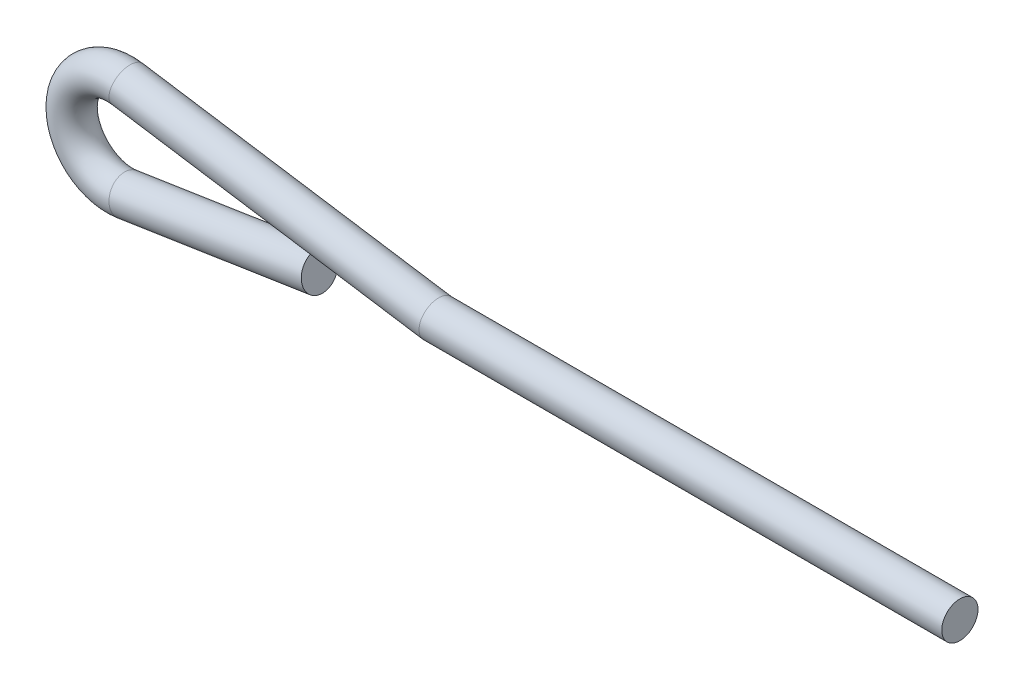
ISO-10303-21;
HEADER;
FILE_DESCRIPTION(('STEP AP214'),'2;1');
FILE_NAME('part.step','',(''),(''),'','','');
FILE_SCHEMA(('AUTOMOTIVE_DESIGN { 1 0 10303 214 1 1 1 1 }'));
ENDSEC;
DATA;
#1=APPLICATION_CONTEXT('core data for automotive mechanical design processes');
#2=APPLICATION_PROTOCOL_DEFINITION('international standard','automotive_design',2000,#1);
#3=PRODUCT_CONTEXT('',#1,'mechanical');
#4=PRODUCT('Part','Part','',(#3));
#5=PRODUCT_RELATED_PRODUCT_CATEGORY('part','',(#4));
#6=PRODUCT_DEFINITION_FORMATION('','',#4);
#7=PRODUCT_DEFINITION_CONTEXT('part definition',#1,'design');
#8=PRODUCT_DEFINITION('design','',#6,#7);
#9=PRODUCT_DEFINITION_SHAPE('','',#8);
#10=(LENGTH_UNIT() NAMED_UNIT(*) SI_UNIT(.MILLI.,.METRE.));
#11=(NAMED_UNIT(*) PLANE_ANGLE_UNIT() SI_UNIT($,.RADIAN.));
#12=(NAMED_UNIT(*) SI_UNIT($,.STERADIAN.) SOLID_ANGLE_UNIT());
#13=UNCERTAINTY_MEASURE_WITH_UNIT(LENGTH_MEASURE(1.E-05),#10,'distance_accuracy_value','');
#14=(GEOMETRIC_REPRESENTATION_CONTEXT(3) GLOBAL_UNCERTAINTY_ASSIGNED_CONTEXT((#13)) GLOBAL_UNIT_ASSIGNED_CONTEXT((#10,
#11,#12)) REPRESENTATION_CONTEXT('',''));
#15=CARTESIAN_POINT('',(0.,0.,0.));
#16=DIRECTION('',(0.,0.,1.));
#17=DIRECTION('',(1.,0.,0.));
#18=AXIS2_PLACEMENT_3D('',#15,#16,#17);
#19=CARTESIAN_POINT('',(105.,0.,0.));
#20=DIRECTION('',(1.,0.,0.));
#21=DIRECTION('',(0.,1.,0.));
#22=AXIS2_PLACEMENT_3D('',#19,#20,#21);
#23=CYLINDRICAL_SURFACE('',#22,6.);
#24=CARTESIAN_POINT('',(105.,0.,0.));
#25=DIRECTION('',(0.99707618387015,-0.0764138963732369,0.));
#26=DIRECTION('',(-0.0764138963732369,-0.99707618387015,0.));
#27=AXIS2_PLACEMENT_3D('',#24,#25,#26);
#28=ELLIPSE('',#27,6.01759433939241,6.);
#29=CARTESIAN_POINT('',(104.540172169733,-6.00000000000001,0.));
#30=VERTEX_POINT('',#29);
#31=EDGE_CURVE('E49',#30,#30,#28,.F.);
#32=ORIENTED_EDGE('',*,*,#31,.F.);
#33=EDGE_LOOP('',(#32));
#34=FACE_BOUND('',#33,.T.);
#35=CARTESIAN_POINT('',(278.,0.,0.));
#36=DIRECTION('',(1.,0.,0.));
#37=DIRECTION('',(0.,1.,0.));
#38=AXIS2_PLACEMENT_3D('',#35,#36,#37);
#39=CIRCLE('',#38,6.);
#40=CARTESIAN_POINT('',(278.,6.00000000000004,0.));
#41=VERTEX_POINT('',#40);
#42=EDGE_CURVE('E11',#41,#41,#39,.T.);
#43=ORIENTED_EDGE('',*,*,#42,.F.);
#44=EDGE_LOOP('',(#43));
#45=FACE_BOUND('',#44,.T.);
#46=ADVANCED_FACE('F43',(#34,#45),#23,.T.);
#47=CARTESIAN_POINT('',(2.43809523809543,15.8131493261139,0.));
#48=DIRECTION('',(0.98832183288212,-0.152380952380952,0.));
#49=DIRECTION('',(0.152380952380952,0.98832183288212,0.));
#50=AXIS2_PLACEMENT_3D('',#47,#48,#49);
#51=CYLINDRICAL_SURFACE('',#50,6.);
#52=CARTESIAN_POINT('',(2.43809523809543,15.8131493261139,0.));
#53=DIRECTION('',(0.988321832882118,-0.152380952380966,0.));
#54=DIRECTION('',(0.152380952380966,0.988321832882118,0.));
#55=AXIS2_PLACEMENT_3D('',#52,#53,#54);
#56=CIRCLE('',#55,6.);
#57=CARTESIAN_POINT('',(3.35238095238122,21.7430803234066,0.));
#58=VERTEX_POINT('',#57);
#59=EDGE_CURVE('E54',#58,#58,#56,.T.);
#60=ORIENTED_EDGE('',*,*,#59,.T.);
#61=EDGE_LOOP('',(#60));
#62=FACE_BOUND('',#61,.T.);
#63=ORIENTED_EDGE('',*,*,#31,.T.);
#64=EDGE_LOOP('',(#63));
#65=FACE_BOUND('',#64,.T.);
#66=ADVANCED_FACE('F86',(#62,#65),#51,.T.);
#67=CARTESIAN_POINT('',(0.,0.,0.));
#68=DIRECTION('',(0.,0.,-1.));
#69=DIRECTION('',(-1.,0.,0.));
#70=AXIS2_PLACEMENT_3D('',#67,#68,#69);
#71=TOROIDAL_SURFACE('',#70,16.,6.);
#72=CARTESIAN_POINT('',(2.43809523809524,-15.8131493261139,0.));
#73=DIRECTION('',(-0.988321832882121,-0.152380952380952,0.));
#74=DIRECTION('',(0.152380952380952,-0.988321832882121,0.));
#75=AXIS2_PLACEMENT_3D('',#72,#73,#74);
#76=CIRCLE('',#75,6.);
#77=CARTESIAN_POINT('',(3.35238095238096,-21.7430803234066,0.));
#78=VERTEX_POINT('',#77);
#79=EDGE_CURVE('E60',#78,#78,#76,.T.);
#80=CARTESIAN_POINT('',(0.,0.,0.));
#81=DIRECTION('',(0.,0.,-1.));
#82=DIRECTION('',(-1.,0.,0.));
#83=AXIS2_PLACEMENT_3D('',#80,#81,#82);
#84=CIRCLE('',#83,22.);
#85=EDGE_CURVE('',#78,#58,#84,.T.);
#86=ORIENTED_EDGE('',*,*,#79,.T.);
#87=ORIENTED_EDGE('',*,*,#59,.F.);
#88=ORIENTED_EDGE('',*,*,#85,.T.);
#89=ORIENTED_EDGE('',*,*,#85,.F.);
#90=EDGE_LOOP('',(#86,#88,#87,#89));
#91=FACE_BOUND('',#90,.T.);
#92=ADVANCED_FACE('F69',(#91),#71,.T.);
#93=CARTESIAN_POINT('',(2.43809523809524,-15.8131493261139,0.));
#94=DIRECTION('',(0.98832183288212,0.152380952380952,0.));
#95=DIRECTION('',(-0.152380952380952,0.988321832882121,0.));
#96=AXIS2_PLACEMENT_3D('',#93,#94,#95);
#97=CYLINDRICAL_SURFACE('',#96,6.);
#98=ORIENTED_EDGE('',*,*,#79,.F.);
#99=EDGE_LOOP('',(#98));
#100=FACE_BOUND('',#99,.T.);
#101=CARTESIAN_POINT('',(66.0848278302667,-5.99999999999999,0.));
#102=DIRECTION('',(-0.988321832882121,-0.152380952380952,0.));
#103=DIRECTION('',(0.152380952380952,-0.988321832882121,0.));
#104=AXIS2_PLACEMENT_3D('',#101,#102,#103);
#105=CIRCLE('',#104,6.);
#106=CARTESIAN_POINT('',(66.9991135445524,-11.9299309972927,0.));
#107=VERTEX_POINT('',#106);
#108=EDGE_CURVE('E63',#107,#107,#105,.T.);
#109=ORIENTED_EDGE('',*,*,#108,.T.);
#110=EDGE_LOOP('',(#109));
#111=FACE_BOUND('',#110,.T.);
#112=ADVANCED_FACE('F72',(#100,#111),#97,.T.);
#113=CARTESIAN_POINT('',(66.0848278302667,-5.99999999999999,0.));
#114=DIRECTION('',(-0.988321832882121,-0.152380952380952,0.));
#115=DIRECTION('',(0.152380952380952,-0.988321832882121,0.));
#116=AXIS2_PLACEMENT_3D('',#113,#114,#115);
#117=PLANE('',#116);
#118=ORIENTED_EDGE('',*,*,#108,.F.);
#119=EDGE_LOOP('',(#118));
#120=FACE_BOUND('',#119,.T.);
#121=ADVANCED_FACE('F75',(#120),#117,.F.);
#122=CARTESIAN_POINT('',(278.,0.,0.));
#123=DIRECTION('',(1.,0.,0.));
#124=DIRECTION('',(0.,1.,0.));
#125=AXIS2_PLACEMENT_3D('',#122,#123,#124);
#126=PLANE('',#125);
#127=ORIENTED_EDGE('',*,*,#42,.T.);
#128=EDGE_LOOP('',(#127));
#129=FACE_BOUND('',#128,.T.);
#130=ADVANCED_FACE('F80',(#129),#126,.T.);
#131=CLOSED_SHELL('',(#46,#66,#92,#112,#121,#130));
#132=MANIFOLD_SOLID_BREP('B2',#131);
#133=ADVANCED_BREP_SHAPE_REPRESENTATION('',(#18,#132),#14);
#134=SHAPE_DEFINITION_REPRESENTATION(#9,#133);
ENDSEC;
END-ISO-10303-21;
